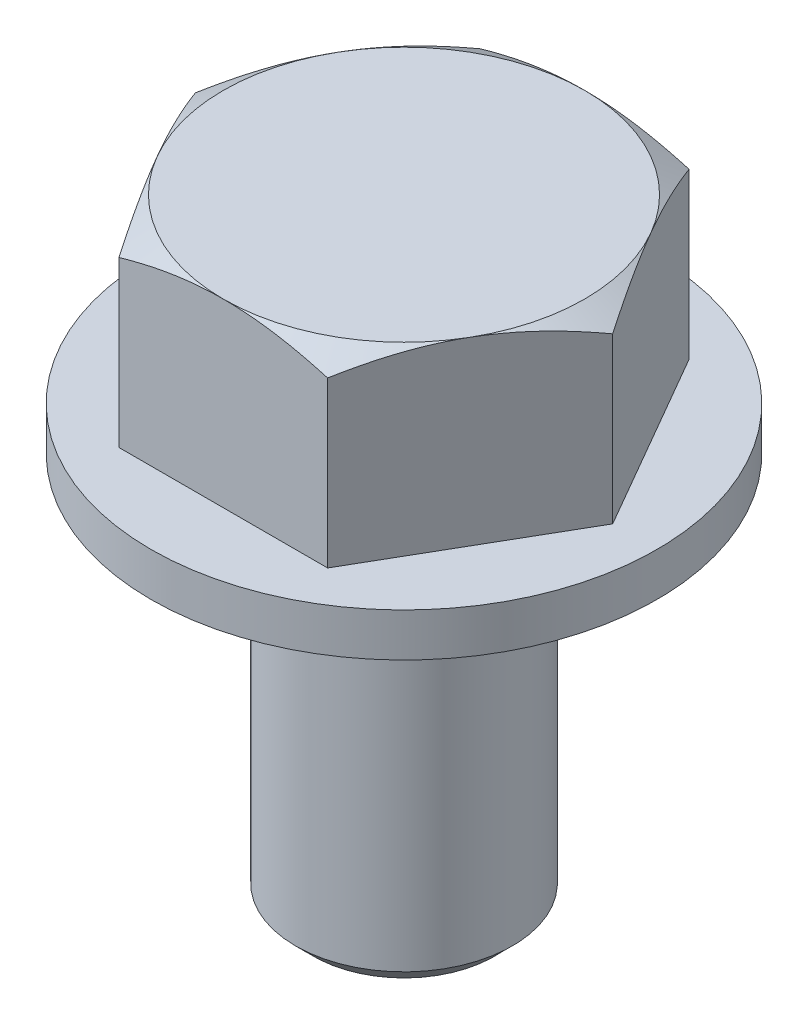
ISO-10303-21;
HEADER;
FILE_DESCRIPTION(('STEP AP214'),'2;1');
FILE_NAME('part.step','',(''),(''),'','','');
FILE_SCHEMA(('AUTOMOTIVE_DESIGN { 1 0 10303 214 1 1 1 1 }'));
ENDSEC;
DATA;
#1=APPLICATION_CONTEXT('core data for automotive mechanical design processes');
#2=APPLICATION_PROTOCOL_DEFINITION('international standard','automotive_design',2000,#1);
#3=PRODUCT_CONTEXT('',#1,'mechanical');
#4=PRODUCT('Part','Part','',(#3));
#5=PRODUCT_RELATED_PRODUCT_CATEGORY('part','',(#4));
#6=PRODUCT_DEFINITION_FORMATION('','',#4);
#7=PRODUCT_DEFINITION_CONTEXT('part definition',#1,'design');
#8=PRODUCT_DEFINITION('design','',#6,#7);
#9=PRODUCT_DEFINITION_SHAPE('','',#8);
#10=(LENGTH_UNIT() NAMED_UNIT(*) SI_UNIT(.MILLI.,.METRE.));
#11=(NAMED_UNIT(*) PLANE_ANGLE_UNIT() SI_UNIT($,.RADIAN.));
#12=(NAMED_UNIT(*) SI_UNIT($,.STERADIAN.) SOLID_ANGLE_UNIT());
#13=UNCERTAINTY_MEASURE_WITH_UNIT(LENGTH_MEASURE(1.E-05),#10,'distance_accuracy_value','');
#14=(GEOMETRIC_REPRESENTATION_CONTEXT(3) GLOBAL_UNCERTAINTY_ASSIGNED_CONTEXT((#13)) GLOBAL_UNIT_ASSIGNED_CONTEXT((#10,
#11,#12)) REPRESENTATION_CONTEXT('',''));
#15=CARTESIAN_POINT('',(0.,0.,0.));
#16=DIRECTION('',(0.,0.,1.));
#17=DIRECTION('',(1.,0.,0.));
#18=AXIS2_PLACEMENT_3D('',#15,#16,#17);
#19=CARTESIAN_POINT('',(8.66025403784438,-2.5,-5.00000000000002));
#20=DIRECTION('',(0.,1.,0.));
#21=DIRECTION('',(0.,0.,1.));
#22=AXIS2_PLACEMENT_3D('',#19,#20,#21);
#23=PLANE('',#22);
#24=CARTESIAN_POINT('',(0.,-2.5,0.));
#25=DIRECTION('',(0.,1.,0.));
#26=DIRECTION('',(0.,0.,1.));
#27=AXIS2_PLACEMENT_3D('',#24,#25,#26);
#28=CIRCLE('',#27,3.);
#29=CARTESIAN_POINT('',(0.,-2.5,3.));
#30=VERTEX_POINT('',#29);
#31=EDGE_CURVE('E147',#30,#30,#28,.F.);
#32=ORIENTED_EDGE('',*,*,#31,.F.);
#33=EDGE_LOOP('',(#32));
#34=FACE_BOUND('',#33,.T.);
#35=CARTESIAN_POINT('',(0.,-2.5,0.));
#36=DIRECTION('',(0.,1.,0.));
#37=DIRECTION('',(0.,0.,1.));
#38=AXIS2_PLACEMENT_3D('',#35,#36,#37);
#39=CIRCLE('',#38,3.5);
#40=CARTESIAN_POINT('',(0.,-2.5,3.5));
#41=VERTEX_POINT('',#40);
#42=EDGE_CURVE('E11',#41,#41,#39,.T.);
#43=ORIENTED_EDGE('',*,*,#42,.F.);
#44=EDGE_LOOP('',(#43));
#45=FACE_BOUND('',#44,.T.);
#46=ADVANCED_FACE('F31',(#34,#45),#23,.F.);
#47=CARTESIAN_POINT('',(0.,-14.5,0.));
#48=DIRECTION('',(0.,1.,0.));
#49=DIRECTION('',(0.,0.,1.));
#50=AXIS2_PLACEMENT_3D('',#47,#48,#49);
#51=CYLINDRICAL_SURFACE('',#50,3.);
#52=CARTESIAN_POINT('',(0.,-14.,0.));
#53=DIRECTION('',(0.,-1.,0.));
#54=DIRECTION('',(0.,0.,-1.));
#55=AXIS2_PLACEMENT_3D('',#52,#53,#54);
#56=CIRCLE('',#55,3.);
#57=CARTESIAN_POINT('',(0.,-14.,-3.));
#58=VERTEX_POINT('',#57);
#59=EDGE_CURVE('E40',#58,#58,#56,.F.);
#60=ORIENTED_EDGE('',*,*,#59,.T.);
#61=EDGE_LOOP('',(#60));
#62=FACE_BOUND('',#61,.T.);
#63=ORIENTED_EDGE('',*,*,#31,.T.);
#64=EDGE_LOOP('',(#63));
#65=FACE_BOUND('',#64,.T.);
#66=ADVANCED_FACE('F155',(#62,#65),#51,.T.);
#67=CARTESIAN_POINT('',(0.,-14.5,0.));
#68=DIRECTION('',(0.,-1.,0.));
#69=DIRECTION('',(0.,0.,-1.));
#70=AXIS2_PLACEMENT_3D('',#67,#68,#69);
#71=PLANE('',#70);
#72=CARTESIAN_POINT('',(0.,-14.5,0.));
#73=DIRECTION('',(0.,-1.,0.));
#74=DIRECTION('',(0.,0.,-1.));
#75=AXIS2_PLACEMENT_3D('',#72,#73,#74);
#76=CIRCLE('',#75,2.5);
#77=CARTESIAN_POINT('',(0.,-14.5,-2.5));
#78=VERTEX_POINT('',#77);
#79=EDGE_CURVE('E150',#78,#78,#76,.T.);
#80=ORIENTED_EDGE('',*,*,#79,.T.);
#81=EDGE_LOOP('',(#80));
#82=FACE_BOUND('',#81,.T.);
#83=ADVANCED_FACE('F161',(#82),#71,.T.);
#84=CARTESIAN_POINT('',(0.,-14.5,0.));
#85=DIRECTION('',(0.,1.,0.));
#86=DIRECTION('',(0.,0.,1.));
#87=AXIS2_PLACEMENT_3D('',#84,#85,#86);
#88=CONICAL_SURFACE('',#87,2.5,0.785398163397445);
#89=ORIENTED_EDGE('',*,*,#59,.F.);
#90=EDGE_LOOP('',(#89));
#91=FACE_BOUND('',#90,.T.);
#92=ORIENTED_EDGE('',*,*,#79,.F.);
#93=EDGE_LOOP('',(#92));
#94=FACE_BOUND('',#93,.T.);
#95=ADVANCED_FACE('F158',(#91,#94),#88,.T.);
#96=CARTESIAN_POINT('',(3.5,-2.5,0.));
#97=DIRECTION('',(0.,-1.,0.));
#98=DIRECTION('',(0.,0.,-1.));
#99=AXIS2_PLACEMENT_3D('',#96,#97,#98);
#100=PLANE('',#99);
#101=CARTESIAN_POINT('',(0.,-2.5,0.));
#102=DIRECTION('',(0.,1.,0.));
#103=DIRECTION('',(0.,0.,1.));
#104=AXIS2_PLACEMENT_3D('',#101,#102,#103);
#105=CIRCLE('',#104,7.);
#106=CARTESIAN_POINT('',(0.,-2.5,7.));
#107=VERTEX_POINT('',#106);
#108=EDGE_CURVE('E428',#107,#107,#105,.T.);
#109=ORIENTED_EDGE('',*,*,#108,.T.);
#110=EDGE_LOOP('',(#109));
#111=FACE_BOUND('',#110,.T.);
#112=DIRECTION('',(-0.5,0.,-0.866025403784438));
#113=VECTOR('',#112,1.);
#114=CARTESIAN_POINT('',(5.77350269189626,-2.5,0.));
#115=LINE('',#114,#113);
#116=CARTESIAN_POINT('',(5.77350269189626,-2.5,0.));
#117=VERTEX_POINT('',#116);
#118=CARTESIAN_POINT('',(2.88675134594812,-2.5,-5.00000000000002));
#119=VERTEX_POINT('',#118);
#120=EDGE_CURVE('E245',#117,#119,#115,.T.);
#121=ORIENTED_EDGE('',*,*,#120,.F.);
#122=DIRECTION('',(0.499999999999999,0.,-0.866025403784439));
#123=VECTOR('',#122,1.);
#124=CARTESIAN_POINT('',(2.88675134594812,-2.5,5.00000000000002));
#125=LINE('',#124,#123);
#126=CARTESIAN_POINT('',(2.88675134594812,-2.5,5.00000000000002));
#127=VERTEX_POINT('',#126);
#128=EDGE_CURVE('E55',#127,#117,#125,.T.);
#129=ORIENTED_EDGE('',*,*,#128,.F.);
#130=DIRECTION('',(1.,0.,0.));
#131=VECTOR('',#130,1.);
#132=CARTESIAN_POINT('',(-2.88675134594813,-2.5,5.00000000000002));
#133=LINE('',#132,#131);
#134=CARTESIAN_POINT('',(-2.88675134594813,-2.5,5.00000000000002));
#135=VERTEX_POINT('',#134);
#136=EDGE_CURVE('E103',#135,#127,#133,.T.);
#137=ORIENTED_EDGE('',*,*,#136,.F.);
#138=DIRECTION('',(0.5,0.,0.866025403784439));
#139=VECTOR('',#138,1.);
#140=CARTESIAN_POINT('',(-5.77350269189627,-2.5,0.));
#141=LINE('',#140,#139);
#142=CARTESIAN_POINT('',(-5.77350269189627,-2.5,0.));
#143=VERTEX_POINT('',#142);
#144=EDGE_CURVE('E107',#143,#135,#141,.T.);
#145=ORIENTED_EDGE('',*,*,#144,.F.);
#146=DIRECTION('',(-0.5,0.,0.866025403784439));
#147=VECTOR('',#146,1.);
#148=CARTESIAN_POINT('',(-2.88675134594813,-2.5,-5.00000000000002));
#149=LINE('',#148,#147);
#150=CARTESIAN_POINT('',(-2.88675134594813,-2.5,-5.00000000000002));
#151=VERTEX_POINT('',#150);
#152=EDGE_CURVE('E127',#151,#143,#149,.T.);
#153=ORIENTED_EDGE('',*,*,#152,.F.);
#154=DIRECTION('',(-1.,0.,0.));
#155=VECTOR('',#154,1.);
#156=CARTESIAN_POINT('',(2.88675134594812,-2.5,-5.00000000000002));
#157=LINE('',#156,#155);
#158=EDGE_CURVE('E129',#119,#151,#157,.T.);
#159=ORIENTED_EDGE('',*,*,#158,.F.);
#160=EDGE_LOOP('',(#121,#129,#137,#145,#153,#159));
#161=FACE_BOUND('',#160,.T.);
#162=ADVANCED_FACE('F105',(#111,#161),#100,.F.);
#163=CARTESIAN_POINT('',(0.,0.,0.));
#164=DIRECTION('',(0.,1.,0.));
#165=DIRECTION('',(0.,0.,1.));
#166=AXIS2_PLACEMENT_3D('',#163,#164,#165);
#167=CYLINDRICAL_SURFACE('',#166,3.5);
#168=CARTESIAN_POINT('',(0.,-3.7,0.));
#169=DIRECTION('',(0.,1.,0.));
#170=DIRECTION('',(0.,0.,1.));
#171=AXIS2_PLACEMENT_3D('',#168,#169,#170);
#172=CIRCLE('',#171,3.5);
#173=CARTESIAN_POINT('',(0.,-3.7,3.5));
#174=VERTEX_POINT('',#173);
#175=EDGE_CURVE('E200',#174,#174,#172,.T.);
#176=ORIENTED_EDGE('',*,*,#175,.F.);
#177=EDGE_LOOP('',(#176));
#178=FACE_BOUND('',#177,.T.);
#179=ORIENTED_EDGE('',*,*,#42,.T.);
#180=EDGE_LOOP('',(#179));
#181=FACE_BOUND('',#180,.T.);
#182=ADVANCED_FACE('F349',(#178,#181),#167,.F.);
#183=CARTESIAN_POINT('',(3.5,-3.7,0.));
#184=DIRECTION('',(0.,1.,0.));
#185=DIRECTION('',(0.,0.,1.));
#186=AXIS2_PLACEMENT_3D('',#183,#184,#185);
#187=PLANE('',#186);
#188=CARTESIAN_POINT('',(0.,-3.7,0.));
#189=DIRECTION('',(0.,1.,0.));
#190=DIRECTION('',(0.,0.,1.));
#191=AXIS2_PLACEMENT_3D('',#188,#189,#190);
#192=CIRCLE('',#191,7.);
#193=CARTESIAN_POINT('',(0.,-3.7,7.));
#194=VERTEX_POINT('',#193);
#195=EDGE_CURVE('E431',#194,#194,#192,.T.);
#196=ORIENTED_EDGE('',*,*,#195,.F.);
#197=EDGE_LOOP('',(#196));
#198=FACE_BOUND('',#197,.T.);
#199=ORIENTED_EDGE('',*,*,#175,.T.);
#200=EDGE_LOOP('',(#199));
#201=FACE_BOUND('',#200,.T.);
#202=ADVANCED_FACE('F359',(#198,#201),#187,.F.);
#203=CARTESIAN_POINT('',(0.,0.,0.));
#204=DIRECTION('',(0.,1.,0.));
#205=DIRECTION('',(0.,0.,1.));
#206=AXIS2_PLACEMENT_3D('',#203,#204,#205);
#207=CYLINDRICAL_SURFACE('',#206,7.);
#208=ORIENTED_EDGE('',*,*,#108,.F.);
#209=EDGE_LOOP('',(#208));
#210=FACE_BOUND('',#209,.T.);
#211=ORIENTED_EDGE('',*,*,#195,.T.);
#212=EDGE_LOOP('',(#211));
#213=FACE_BOUND('',#212,.T.);
#214=ADVANCED_FACE('F186',(#210,#213),#207,.T.);
#215=CARTESIAN_POINT('',(8.66025403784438,2.5,-5.00000000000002));
#216=DIRECTION('',(0.,1.,0.));
#217=DIRECTION('',(0.,0.,1.));
#218=AXIS2_PLACEMENT_3D('',#215,#216,#217);
#219=PLANE('',#218);
#220=CARTESIAN_POINT('',(0.,2.5,0.));
#221=DIRECTION('',(0.,1.,0.));
#222=DIRECTION('',(0.,0.,1.));
#223=AXIS2_PLACEMENT_3D('',#220,#221,#222);
#224=CIRCLE('',#223,5.00000000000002);
#225=CARTESIAN_POINT('',(-4.3301270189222,2.5,2.5));
#226=VERTEX_POINT('',#225);
#227=CARTESIAN_POINT('',(0.,2.5,5.00000000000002));
#228=VERTEX_POINT('',#227);
#229=EDGE_CURVE('E47',#226,#228,#224,.T.);
#230=ORIENTED_EDGE('',*,*,#229,.T.);
#231=CARTESIAN_POINT('',(4.33012701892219,2.5,2.5));
#232=VERTEX_POINT('',#231);
#233=EDGE_CURVE('E146',#228,#232,#224,.T.);
#234=ORIENTED_EDGE('',*,*,#233,.T.);
#235=CARTESIAN_POINT('',(4.3301270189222,2.5,-2.5));
#236=VERTEX_POINT('',#235);
#237=EDGE_CURVE('E266',#232,#236,#224,.T.);
#238=ORIENTED_EDGE('',*,*,#237,.T.);
#239=CARTESIAN_POINT('',(0.,2.5,-5.00000000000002));
#240=VERTEX_POINT('',#239);
#241=EDGE_CURVE('E265',#236,#240,#224,.T.);
#242=ORIENTED_EDGE('',*,*,#241,.T.);
#243=CARTESIAN_POINT('',(-4.3301270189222,2.5,-2.5));
#244=VERTEX_POINT('',#243);
#245=EDGE_CURVE('E259',#240,#244,#224,.T.);
#246=ORIENTED_EDGE('',*,*,#245,.T.);
#247=EDGE_CURVE('E145',#244,#226,#224,.T.);
#248=ORIENTED_EDGE('',*,*,#247,.T.);
#249=EDGE_LOOP('',(#230,#234,#238,#242,#246,#248));
#250=FACE_BOUND('',#249,.T.);
#251=ADVANCED_FACE('F182',(#250),#219,.T.);
#252=CARTESIAN_POINT('',(0.,4.23205080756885,0.));
#253=DIRECTION('',(0.,-1.,0.));
#254=DIRECTION('',(0.,0.,-1.));
#255=AXIS2_PLACEMENT_3D('',#252,#253,#254);
#256=CONICAL_SURFACE('',#255,2.00000000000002,1.0471975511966);
#257=CARTESIAN_POINT('',(5.7736181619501,2.05335134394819,0.000199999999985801));
#258=CARTESIAN_POINT('',(5.64675433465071,2.12661343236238,-0.219534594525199));
#259=CARTESIAN_POINT('',(5.5188054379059,2.19324867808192,-0.441148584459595));
#260=CARTESIAN_POINT('',(5.26069210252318,2.3095610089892,-0.888213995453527));
#261=CARTESIAN_POINT('',(5.13052307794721,2.35919695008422,-1.11367335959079));
#262=CARTESIAN_POINT('',(4.87177839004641,2.43644897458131,-1.56183230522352));
#263=CARTESIAN_POINT('',(4.74324302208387,2.46457962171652,-1.7844620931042));
#264=CARTESIAN_POINT('',(4.54998783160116,2.48980507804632,-2.11918990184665));
#265=CARTESIAN_POINT('',(4.48552534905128,2.49538654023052,-2.23084219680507));
#266=CARTESIAN_POINT('',(4.35654081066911,2.50079778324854,-2.45424997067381));
#267=CARTESIAN_POINT('',(4.2920187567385,2.5006277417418,-2.56600544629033));
#268=CARTESIAN_POINT('',(4.11524635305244,2.49224636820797,-2.87218423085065));
#269=CARTESIAN_POINT('',(4.00305457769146,2.47817022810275,-3.06650608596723));
#270=CARTESIAN_POINT('',(3.77941563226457,2.43353474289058,-3.45386010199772));
#271=CARTESIAN_POINT('',(3.66796924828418,2.4029601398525,-3.64689090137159));
#272=CARTESIAN_POINT('',(3.44387972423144,2.32653150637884,-4.03502534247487));
#273=CARTESIAN_POINT('',(3.3312648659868,2.28035362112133,-4.23007999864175));
#274=CARTESIAN_POINT('',(3.1077146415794,2.17554820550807,-4.61728034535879));
#275=CARTESIAN_POINT('',(2.99677641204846,2.11694529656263,-4.80943099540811));
#276=CARTESIAN_POINT('',(2.88663587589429,2.05335134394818,-5.00020000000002));
#277=B_SPLINE_CURVE_WITH_KNOTS('',3,(#257,#258,#259,#260,#261,#262,#263,#264,#265,#266,#267,
#268,#269,#270,#271,#272,#273,#274,#275,#276),.UNSPECIFIED.,.F.,.F.,(4,2,2,2,2,2,2,2,2,4),(0.,
0.79255584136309,1.58701660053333,2.3618153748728,2.74884076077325,3.13585419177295,
3.80962362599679,4.48401723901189,5.17336882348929,5.86136694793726),.UNSPECIFIED.);
#278=CARTESIAN_POINT('',(5.77350269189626,2.05341801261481,0.));
#279=VERTEX_POINT('',#278);
#280=EDGE_CURVE('E207',#279,#236,#277,.T.);
#281=ORIENTED_EDGE('',*,*,#280,.T.);
#282=ORIENTED_EDGE('',*,*,#237,.F.);
#283=CARTESIAN_POINT('',(2.88663587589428,2.05335134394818,5.00020000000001));
#284=CARTESIAN_POINT('',(3.01349970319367,2.12661343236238,4.78046540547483));
#285=CARTESIAN_POINT('',(3.14144859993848,2.19324867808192,4.55885141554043));
#286=CARTESIAN_POINT('',(3.3995619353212,2.3095610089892,4.1117860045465));
#287=CARTESIAN_POINT('',(3.52973095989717,2.35919695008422,3.88632664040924));
#288=CARTESIAN_POINT('',(3.78847564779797,2.43644897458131,3.4381676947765));
#289=CARTESIAN_POINT('',(3.91701101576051,2.46457962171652,3.21553790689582));
#290=CARTESIAN_POINT('',(4.11026620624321,2.48980507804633,2.88081009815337));
#291=CARTESIAN_POINT('',(4.1747286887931,2.49538654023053,2.76915780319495));
#292=CARTESIAN_POINT('',(4.30371322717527,2.50079778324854,2.54575002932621));
#293=CARTESIAN_POINT('',(4.36823528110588,2.50062774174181,2.4339945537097));
#294=CARTESIAN_POINT('',(4.54500768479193,2.49224636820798,2.12781576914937));
#295=CARTESIAN_POINT('',(4.65719946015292,2.47817022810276,1.93349391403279));
#296=CARTESIAN_POINT('',(4.88083840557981,2.43353474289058,1.5461398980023));
#297=CARTESIAN_POINT('',(4.9922847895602,2.40296013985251,1.35310909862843));
#298=CARTESIAN_POINT('',(5.21637431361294,2.32653150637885,0.964974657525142));
#299=CARTESIAN_POINT('',(5.32898917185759,2.28035362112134,0.769920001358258));
#300=CARTESIAN_POINT('',(5.55253939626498,2.17554820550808,0.382719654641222));
#301=CARTESIAN_POINT('',(5.66347762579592,2.11694529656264,0.190569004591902));
#302=CARTESIAN_POINT('',(5.7736181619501,2.05335134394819,-0.000200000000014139));
#303=B_SPLINE_CURVE_WITH_KNOTS('',3,(#283,#284,#285,#286,#287,#288,#289,#290,#291,#292,#293,
#294,#295,#296,#297,#298,#299,#300,#301,#302),.UNSPECIFIED.,.F.,.F.,(4,2,2,2,2,2,2,2,2,4),(0.,
0.792555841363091,1.58701660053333,2.36181537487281,2.74884076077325,3.13585419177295,
3.8096236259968,4.48401723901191,5.17336882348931,5.86136694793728),.UNSPECIFIED.);
#304=EDGE_CURVE('E199',#232,#279,#303,.T.);
#305=ORIENTED_EDGE('',*,*,#304,.T.);
#306=EDGE_LOOP('',(#281,#282,#305));
#307=FACE_BOUND('',#306,.T.);
#308=ADVANCED_FACE('F185',(#307),#256,.T.);
#309=CARTESIAN_POINT('',(-7.83582824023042,0.0201818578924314,-5.00000000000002));
#310=CARTESIAN_POINT('',(-7.61675258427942,0.126778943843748,-5.00000000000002));
#311=CARTESIAN_POINT('',(-7.39718272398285,0.232377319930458,-5.00000000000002));
#312=CARTESIAN_POINT('',(-6.95679209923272,0.441016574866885,-5.00000000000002));
#313=CARTESIAN_POINT('',(-6.73597115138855,0.54405706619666,-5.00000000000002));
#314=CARTESIAN_POINT('',(-6.29171673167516,0.747521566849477,-5.00000000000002));
#315=CARTESIAN_POINT('',(-6.06827562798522,0.847928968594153,-5.00000000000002));
#316=CARTESIAN_POINT('',(-5.61964466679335,1.04474266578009,-5.00000000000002));
#317=CARTESIAN_POINT('',(-5.39445489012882,1.14114914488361,-5.00000000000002));
#318=CARTESIAN_POINT('',(-4.93438073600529,1.33205603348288,-5.00000000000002));
#319=CARTESIAN_POINT('',(-4.69942447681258,1.42638413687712,-5.00000000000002));
#320=CARTESIAN_POINT('',(-4.22679335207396,1.60809698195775,-5.00000000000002));
#321=CARTESIAN_POINT('',(-3.98911818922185,1.69548095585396,-5.00000000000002));
#322=CARTESIAN_POINT('',(-3.51109032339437,1.86107114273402,-5.00000000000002));
#323=CARTESIAN_POINT('',(-3.27074388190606,1.93929525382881,-5.00000000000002));
#324=CARTESIAN_POINT('',(-2.78660382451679,2.08410963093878,-5.00000000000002));
#325=CARTESIAN_POINT('',(-2.54281129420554,2.15070347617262,-5.00000000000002));
#326=CARTESIAN_POINT('',(-2.05301710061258,2.26875493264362,-5.00000000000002));
#327=CARTESIAN_POINT('',(-1.80703640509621,2.32029796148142,-5.00000000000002));
#328=CARTESIAN_POINT('',(-1.31193168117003,2.40539626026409,-5.00000000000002));
#329=CARTESIAN_POINT('',(-1.0628079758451,2.43895336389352,-5.00000000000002));
#330=CARTESIAN_POINT('',(-0.565948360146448,2.48496717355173,-5.00000000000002));
#331=CARTESIAN_POINT('',(-0.318238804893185,2.49770143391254,-5.00000000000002));
#332=CARTESIAN_POINT('',(0.177377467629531,2.50172580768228,-5.00000000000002));
#333=CARTESIAN_POINT('',(0.425284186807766,2.4930157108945,-5.00000000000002));
#334=CARTESIAN_POINT('',(0.843772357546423,2.46083600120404,-5.00000000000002));
#335=CARTESIAN_POINT('',(1.01479089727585,2.44270146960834,-5.00000000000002));
#336=CARTESIAN_POINT('',(1.35562158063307,2.39731277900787,-5.00000000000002));
#337=CARTESIAN_POINT('',(1.52543356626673,2.37005744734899,-5.00000000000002));
#338=CARTESIAN_POINT('',(2.0328088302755,2.2760379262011,-5.00000000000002));
#339=CARTESIAN_POINT('',(2.36813213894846,2.19703587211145,-5.00000000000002));
#340=CARTESIAN_POINT('',(2.86963272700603,2.05946652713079,-5.00000000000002));
#341=CARTESIAN_POINT('',(3.03839424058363,2.00977811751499,-5.00000000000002));
#342=CARTESIAN_POINT('',(3.37427940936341,1.90509537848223,-5.00000000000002));
#343=CARTESIAN_POINT('',(3.54140305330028,1.85010101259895,-5.00000000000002));
#344=CARTESIAN_POINT('',(3.87406252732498,1.73570084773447,-5.00000000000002));
#345=CARTESIAN_POINT('',(4.03959882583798,1.67629639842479,-5.00000000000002));
#346=CARTESIAN_POINT('',(4.36929036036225,1.55378935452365,-5.00000000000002));
#347=CARTESIAN_POINT('',(4.53344561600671,1.49068681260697,-5.00000000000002));
#348=CARTESIAN_POINT('',(4.93359002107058,1.33251408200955,-5.00000000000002));
#349=CARTESIAN_POINT('',(5.16891080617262,1.23575576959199,-5.00000000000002));
#350=CARTESIAN_POINT('',(5.63743106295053,1.03721704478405,-5.00000000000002));
#351=CARTESIAN_POINT('',(5.87063037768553,0.935436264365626,-5.00000000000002));
#352=CARTESIAN_POINT('',(6.33531777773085,0.727904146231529,-5.00000000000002));
#353=CARTESIAN_POINT('',(6.56680543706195,0.622151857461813,-5.00000000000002));
#354=CARTESIAN_POINT('',(7.02832278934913,0.407506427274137,-5.00000000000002));
#355=CARTESIAN_POINT('',(7.25835244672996,0.298613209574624,-5.00000000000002));
#356=CARTESIAN_POINT('',(7.71747583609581,0.0781683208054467,-5.00000000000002));
#357=CARTESIAN_POINT('',(7.94656809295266,-0.0333864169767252,-5.00000000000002));
#358=CARTESIAN_POINT('',(8.40373705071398,-0.258559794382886,-5.00000000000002));
#359=CARTESIAN_POINT('',(8.63181374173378,-0.372178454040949,-5.00000000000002));
#360=CARTESIAN_POINT('',(9.31470112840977,-0.715524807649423,-5.00000000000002));
#361=CARTESIAN_POINT('',(9.76824174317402,-0.947778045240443,-5.00000000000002));
#362=CARTESIAN_POINT('',(10.6324695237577,-1.39599360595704,-5.00000000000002));
#363=CARTESIAN_POINT('',(11.0433644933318,-1.61155711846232,-5.00000000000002));
#364=CARTESIAN_POINT('',(11.8636388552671,-2.04558815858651,-5.00000000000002));
#365=CARTESIAN_POINT('',(12.2730181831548,-2.26405580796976,-5.00000000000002));
#366=CARTESIAN_POINT('',(13.0894643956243,-2.70257621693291,-5.00000000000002));
#367=CARTESIAN_POINT('',(13.4965345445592,-2.92262290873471,-5.00000000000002));
#368=CARTESIAN_POINT('',(14.3097130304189,-3.36442738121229,-5.00000000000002));
#369=CARTESIAN_POINT('',(14.7158214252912,-3.58618505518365,-5.00000000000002));
#370=CARTESIAN_POINT('',(15.1215799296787,-3.80857680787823,-5.00000000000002));
#371=B_SPLINE_CURVE_WITH_KNOTS('',3,(#309,#310,#311,#312,#313,#314,#315,#316,#317,#318,#319,
#320,#321,#322,#323,#324,#325,#326,#327,#328,#329,#330,#331,#332,#333,#334,#335,#336,#337,#338,
#339,#340,#341,#342,#343,#344,#345,#346,#347,#348,#349,#350,#351,#352,#353,#354,#355,#356,#357,
#358,#359,#360,#361,#362,#363,#364,#365,#366,#367,#368,#369,#370),.UNSPECIFIED.,.F.,.F.,(4,2,2,
2,2,2,2,2,2,2,2,2,2,2,2,2,2,2,2,2,2,2,2,2,2,2,2,2,2,2,4),(0.,0.730907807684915,1.46192568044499,
2.19678752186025,2.93161559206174,3.69108328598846,4.450634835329,5.20867656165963,
5.96648458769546,6.71990430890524,7.47324720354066,8.21646418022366,8.95968844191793,
9.47537174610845,9.99112137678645,11.0231580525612,11.5508843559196,12.0786142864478,
12.6061833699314,13.1337449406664,13.8969744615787,14.6602599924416,15.4237294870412,
16.187217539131,16.9516324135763,17.7160547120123,19.2446573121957,20.636665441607,
22.0287321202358,23.416942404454,24.805066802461),.UNSPECIFIED.);
#372=CARTESIAN_POINT('',(2.88675134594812,2.05341801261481,-5.00000000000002));
#373=VERTEX_POINT('',#372);
#374=EDGE_CURVE('E213',#373,#240,#371,.F.);
#375=ORIENTED_EDGE('',*,*,#374,.T.);
#376=ORIENTED_EDGE('',*,*,#241,.F.);
#377=EDGE_CURVE('E212',#236,#373,#277,.T.);
#378=ORIENTED_EDGE('',*,*,#377,.T.);
#379=EDGE_LOOP('',(#375,#376,#378));
#380=FACE_BOUND('',#379,.T.);
#381=ADVANCED_FACE('F278',(#380),#256,.T.);
#382=CARTESIAN_POINT('',(-2.8866358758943,2.05335134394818,-5.00020000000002));
#383=CARTESIAN_POINT('',(-3.01349970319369,2.12661343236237,-4.78046540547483));
#384=CARTESIAN_POINT('',(-3.1414485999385,2.19324867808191,-4.55885141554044));
#385=CARTESIAN_POINT('',(-3.39956193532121,2.30956100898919,-4.1117860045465));
#386=CARTESIAN_POINT('',(-3.52973095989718,2.35919695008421,-3.88632664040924));
#387=CARTESIAN_POINT('',(-3.78847564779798,2.43644897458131,-3.4381676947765));
#388=CARTESIAN_POINT('',(-3.91701101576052,2.46457962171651,-3.21553790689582));
#389=CARTESIAN_POINT('',(-4.11026620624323,2.48980507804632,-2.88081009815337));
#390=CARTESIAN_POINT('',(-4.17472868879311,2.49538654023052,-2.76915780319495));
#391=CARTESIAN_POINT('',(-4.30371322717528,2.50079778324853,-2.54575002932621));
#392=CARTESIAN_POINT('',(-4.3682352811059,2.5006277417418,-2.4339945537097));
#393=CARTESIAN_POINT('',(-4.54500768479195,2.49224636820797,-2.12781576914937));
#394=CARTESIAN_POINT('',(-4.65719946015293,2.47817022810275,-1.9334939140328));
#395=CARTESIAN_POINT('',(-4.88083840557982,2.43353474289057,-1.5461398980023));
#396=CARTESIAN_POINT('',(-4.99228478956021,2.4029601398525,-1.35310909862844));
#397=CARTESIAN_POINT('',(-5.21637431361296,2.32653150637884,-0.964974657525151));
#398=CARTESIAN_POINT('',(-5.3289891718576,2.28035362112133,-0.769920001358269));
#399=CARTESIAN_POINT('',(-5.55253939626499,2.17554820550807,-0.382719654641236));
#400=CARTESIAN_POINT('',(-5.66347762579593,2.11694529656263,-0.190569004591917));
#401=CARTESIAN_POINT('',(-5.77361816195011,2.05335134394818,0.000199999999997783));
#402=B_SPLINE_CURVE_WITH_KNOTS('',3,(#382,#383,#384,#385,#386,#387,#388,#389,#390,#391,#392,
#393,#394,#395,#396,#397,#398,#399,#400,#401),.UNSPECIFIED.,.F.,.F.,(4,2,2,2,2,2,2,2,2,4),(0.,
0.792555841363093,1.58701660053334,2.36181537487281,2.74884076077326,3.13585419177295,
3.8096236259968,4.4840172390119,5.1733688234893,5.86136694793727),.UNSPECIFIED.);
#403=CARTESIAN_POINT('',(-2.88675134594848,2.05341801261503,-5.00000000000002));
#404=VERTEX_POINT('',#403);
#405=EDGE_CURVE('E231',#404,#244,#402,.T.);
#406=ORIENTED_EDGE('',*,*,#405,.T.);
#407=ORIENTED_EDGE('',*,*,#245,.F.);
#408=EDGE_CURVE('E237',#240,#404,#371,.F.);
#409=ORIENTED_EDGE('',*,*,#408,.T.);
#410=EDGE_LOOP('',(#406,#407,#409));
#411=FACE_BOUND('',#410,.T.);
#412=ADVANCED_FACE('F257',(#411),#256,.T.);
#413=CARTESIAN_POINT('',(-5.77361816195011,2.05335134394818,-0.000200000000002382));
#414=CARTESIAN_POINT('',(-5.64675433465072,2.12661343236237,0.219534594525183));
#415=CARTESIAN_POINT('',(-5.51880543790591,2.19324867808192,0.441148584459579));
#416=CARTESIAN_POINT('',(-5.26069210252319,2.3095610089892,0.888213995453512));
#417=CARTESIAN_POINT('',(-5.13052307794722,2.35919695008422,1.11367335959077));
#418=CARTESIAN_POINT('',(-4.87177839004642,2.43644897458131,1.56183230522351));
#419=CARTESIAN_POINT('',(-4.74324302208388,2.46457962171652,1.78446209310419));
#420=CARTESIAN_POINT('',(-4.54998783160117,2.48980507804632,2.11918990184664));
#421=CARTESIAN_POINT('',(-4.48552534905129,2.49538654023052,2.23084219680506));
#422=CARTESIAN_POINT('',(-4.35654081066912,2.50079778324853,2.4542499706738));
#423=CARTESIAN_POINT('',(-4.29201875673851,2.5006277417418,2.56600544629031));
#424=CARTESIAN_POINT('',(-4.11524635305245,2.49224636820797,2.87218423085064));
#425=CARTESIAN_POINT('',(-4.00305457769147,2.47817022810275,3.06650608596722));
#426=CARTESIAN_POINT('',(-3.77941563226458,2.43353474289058,3.45386010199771));
#427=CARTESIAN_POINT('',(-3.66796924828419,2.4029601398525,3.64689090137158));
#428=CARTESIAN_POINT('',(-3.44387972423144,2.32653150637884,4.03502534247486));
#429=CARTESIAN_POINT('',(-3.33126486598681,2.28035362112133,4.23007999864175));
#430=CARTESIAN_POINT('',(-3.10771464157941,2.17554820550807,4.61728034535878));
#431=CARTESIAN_POINT('',(-2.99677641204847,2.11694529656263,4.8094309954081));
#432=CARTESIAN_POINT('',(-2.88663587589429,2.05335134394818,5.00020000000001));
#433=B_SPLINE_CURVE_WITH_KNOTS('',3,(#413,#414,#415,#416,#417,#418,#419,#420,#421,#422,#423,
#424,#425,#426,#427,#428,#429,#430,#431,#432),.UNSPECIFIED.,.F.,.F.,(4,2,2,2,2,2,2,2,2,4),(0.,
0.792555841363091,1.58701660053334,2.36181537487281,2.74884076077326,3.13585419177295,
3.8096236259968,4.4840172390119,5.1733688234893,5.86136694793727),.UNSPECIFIED.);
#434=CARTESIAN_POINT('',(-5.77350269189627,2.05341801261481,0.));
#435=VERTEX_POINT('',#434);
#436=EDGE_CURVE('E238',#435,#226,#433,.T.);
#437=ORIENTED_EDGE('',*,*,#436,.T.);
#438=ORIENTED_EDGE('',*,*,#247,.F.);
#439=EDGE_CURVE('E236',#244,#435,#402,.T.);
#440=ORIENTED_EDGE('',*,*,#439,.T.);
#441=EDGE_LOOP('',(#437,#438,#440));
#442=FACE_BOUND('',#441,.T.);
#443=ADVANCED_FACE('F262',(#442),#256,.T.);
#444=CARTESIAN_POINT('',(2.88675134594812,2.05341801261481,5.00000000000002));
#445=VERTEX_POINT('',#444);
#446=EDGE_CURVE('E206',#445,#232,#303,.T.);
#447=ORIENTED_EDGE('',*,*,#446,.T.);
#448=ORIENTED_EDGE('',*,*,#233,.F.);
#449=CARTESIAN_POINT('',(-7.83582824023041,0.0201818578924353,5.00000000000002));
#450=CARTESIAN_POINT('',(-7.61675258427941,0.126778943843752,5.00000000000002));
#451=CARTESIAN_POINT('',(-7.39718272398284,0.232377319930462,5.00000000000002));
#452=CARTESIAN_POINT('',(-6.95679209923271,0.441016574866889,5.00000000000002));
#453=CARTESIAN_POINT('',(-6.73597115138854,0.544057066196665,5.00000000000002));
#454=CARTESIAN_POINT('',(-6.29171673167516,0.747521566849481,5.00000000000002));
#455=CARTESIAN_POINT('',(-6.06827562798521,0.847928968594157,5.00000000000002));
#456=CARTESIAN_POINT('',(-5.61964466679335,1.0447426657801,5.00000000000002));
#457=CARTESIAN_POINT('',(-5.39445489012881,1.14114914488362,5.00000000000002));
#458=CARTESIAN_POINT('',(-4.93438073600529,1.33205603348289,5.00000000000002));
#459=CARTESIAN_POINT('',(-4.69942447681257,1.42638413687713,5.00000000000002));
#460=CARTESIAN_POINT('',(-4.22679335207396,1.60809698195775,5.00000000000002));
#461=CARTESIAN_POINT('',(-3.98911818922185,1.69548095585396,5.00000000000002));
#462=CARTESIAN_POINT('',(-3.51109032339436,1.86107114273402,5.00000000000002));
#463=CARTESIAN_POINT('',(-3.27074388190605,1.93929525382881,5.00000000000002));
#464=CARTESIAN_POINT('',(-2.78660382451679,2.08410963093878,5.00000000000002));
#465=CARTESIAN_POINT('',(-2.54281129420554,2.15070347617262,5.00000000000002));
#466=CARTESIAN_POINT('',(-2.05301710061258,2.26875493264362,5.00000000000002));
#467=CARTESIAN_POINT('',(-1.80703640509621,2.32029796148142,5.00000000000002));
#468=CARTESIAN_POINT('',(-1.31193168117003,2.40539626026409,5.00000000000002));
#469=CARTESIAN_POINT('',(-1.0628079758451,2.43895336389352,5.00000000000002));
#470=CARTESIAN_POINT('',(-0.565948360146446,2.48496717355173,5.00000000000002));
#471=CARTESIAN_POINT('',(-0.318238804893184,2.49770143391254,5.00000000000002));
#472=CARTESIAN_POINT('',(0.177377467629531,2.50172580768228,5.00000000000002));
#473=CARTESIAN_POINT('',(0.425284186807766,2.4930157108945,5.00000000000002));
#474=CARTESIAN_POINT('',(0.843772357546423,2.46083600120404,5.00000000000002));
#475=CARTESIAN_POINT('',(1.01479089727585,2.44270146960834,5.00000000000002));
#476=CARTESIAN_POINT('',(1.35562158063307,2.39731277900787,5.00000000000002));
#477=CARTESIAN_POINT('',(1.52543356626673,2.37005744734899,5.00000000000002));
#478=CARTESIAN_POINT('',(2.0328088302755,2.2760379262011,5.00000000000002));
#479=CARTESIAN_POINT('',(2.36813213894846,2.19703587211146,5.00000000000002));
#480=CARTESIAN_POINT('',(2.86963272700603,2.05946652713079,5.00000000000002));
#481=CARTESIAN_POINT('',(3.03839424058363,2.009778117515,5.00000000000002));
#482=CARTESIAN_POINT('',(3.37427940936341,1.90509537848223,5.00000000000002));
#483=CARTESIAN_POINT('',(3.54140305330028,1.85010101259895,5.00000000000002));
#484=CARTESIAN_POINT('',(3.87406252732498,1.73570084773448,5.00000000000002));
#485=CARTESIAN_POINT('',(4.03959882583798,1.6762963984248,5.00000000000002));
#486=CARTESIAN_POINT('',(4.36929036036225,1.55378935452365,5.00000000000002));
#487=CARTESIAN_POINT('',(4.53344561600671,1.49068681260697,5.00000000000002));
#488=CARTESIAN_POINT('',(4.93359002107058,1.33251408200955,5.00000000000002));
#489=CARTESIAN_POINT('',(5.16891080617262,1.23575576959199,5.00000000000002));
#490=CARTESIAN_POINT('',(5.63743106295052,1.03721704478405,5.00000000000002));
#491=CARTESIAN_POINT('',(5.87063037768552,0.935436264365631,5.00000000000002));
#492=CARTESIAN_POINT('',(6.33531777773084,0.727904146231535,5.00000000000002));
#493=CARTESIAN_POINT('',(6.56680543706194,0.62215185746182,5.00000000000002));
#494=CARTESIAN_POINT('',(7.02832278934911,0.407506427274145,5.00000000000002));
#495=CARTESIAN_POINT('',(7.25835244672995,0.298613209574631,5.00000000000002));
#496=CARTESIAN_POINT('',(7.71747583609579,0.078168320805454,5.00000000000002));
#497=CARTESIAN_POINT('',(7.94656809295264,-0.0333864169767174,5.00000000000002));
#498=CARTESIAN_POINT('',(8.40373705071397,-0.258559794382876,5.00000000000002));
#499=CARTESIAN_POINT('',(8.63181374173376,-0.372178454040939,5.00000000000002));
#500=CARTESIAN_POINT('',(9.31470112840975,-0.715524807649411,5.00000000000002));
#501=CARTESIAN_POINT('',(9.76824174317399,-0.94777804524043,5.00000000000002));
#502=CARTESIAN_POINT('',(10.6324695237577,-1.39599360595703,5.00000000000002));
#503=CARTESIAN_POINT('',(11.0433644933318,-1.61155711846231,5.00000000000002));
#504=CARTESIAN_POINT('',(11.8636388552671,-2.0455881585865,5.00000000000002));
#505=CARTESIAN_POINT('',(12.2730181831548,-2.26405580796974,5.00000000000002));
#506=CARTESIAN_POINT('',(13.0894643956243,-2.7025762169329,5.00000000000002));
#507=CARTESIAN_POINT('',(13.4965345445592,-2.92262290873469,5.00000000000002));
#508=CARTESIAN_POINT('',(14.3097130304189,-3.36442738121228,5.00000000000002));
#509=CARTESIAN_POINT('',(14.7158214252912,-3.58618505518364,5.00000000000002));
#510=CARTESIAN_POINT('',(15.1215799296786,-3.80857680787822,5.00000000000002));
#511=B_SPLINE_CURVE_WITH_KNOTS('',3,(#449,#450,#451,#452,#453,#454,#455,#456,#457,#458,#459,
#460,#461,#462,#463,#464,#465,#466,#467,#468,#469,#470,#471,#472,#473,#474,#475,#476,#477,#478,
#479,#480,#481,#482,#483,#484,#485,#486,#487,#488,#489,#490,#491,#492,#493,#494,#495,#496,#497,
#498,#499,#500,#501,#502,#503,#504,#505,#506,#507,#508,#509,#510),.UNSPECIFIED.,.F.,.F.,(4,2,2,
2,2,2,2,2,2,2,2,2,2,2,2,2,2,2,2,2,2,2,2,2,2,2,2,2,2,2,4),(0.,0.730907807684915,1.46192568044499,
2.19678752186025,2.93161559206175,3.69108328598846,4.450634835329,5.20867656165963,
5.96648458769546,6.71990430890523,7.47324720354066,8.21646418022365,8.95968844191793,
9.47537174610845,9.99112137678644,11.0231580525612,11.5508843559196,12.0786142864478,
12.6061833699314,13.1337449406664,13.8969744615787,14.6602599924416,15.4237294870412,
16.1872175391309,16.9516324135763,17.7160547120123,19.2446573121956,20.636665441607,
22.0287321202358,23.416942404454,24.805066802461),.UNSPECIFIED.);
#512=EDGE_CURVE('E193',#228,#445,#511,.T.);
#513=ORIENTED_EDGE('',*,*,#512,.T.);
#514=EDGE_LOOP('',(#447,#448,#513));
#515=FACE_BOUND('',#514,.T.);
#516=ADVANCED_FACE('F284',(#515),#256,.T.);
#517=CARTESIAN_POINT('',(-2.88675134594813,2.0534180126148,5.00000000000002));
#518=VERTEX_POINT('',#517);
#519=EDGE_CURVE('E118',#518,#228,#511,.T.);
#520=ORIENTED_EDGE('',*,*,#519,.T.);
#521=ORIENTED_EDGE('',*,*,#229,.F.);
#522=EDGE_CURVE('E243',#226,#518,#433,.T.);
#523=ORIENTED_EDGE('',*,*,#522,.T.);
#524=EDGE_LOOP('',(#520,#521,#523));
#525=FACE_BOUND('',#524,.T.);
#526=ADVANCED_FACE('F180',(#525),#256,.T.);
#527=CARTESIAN_POINT('',(-2.88675134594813,2.5,5.00000000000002));
#528=DIRECTION('',(0.,0.,-1.));
#529=DIRECTION('',(-1.,0.,0.));
#530=AXIS2_PLACEMENT_3D('',#527,#528,#529);
#531=PLANE('',#530);
#532=ORIENTED_EDGE('',*,*,#519,.F.);
#533=DIRECTION('',(0.,-1.,0.));
#534=VECTOR('',#533,1.);
#535=CARTESIAN_POINT('',(-2.88675134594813,2.5,5.00000000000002));
#536=LINE('',#535,#534);
#537=EDGE_CURVE('E115',#518,#135,#536,.T.);
#538=ORIENTED_EDGE('',*,*,#537,.T.);
#539=ORIENTED_EDGE('',*,*,#136,.T.);
#540=DIRECTION('',(0.,-1.,0.));
#541=VECTOR('',#540,1.);
#542=CARTESIAN_POINT('',(2.88675134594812,2.5,5.00000000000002));
#543=LINE('',#542,#541);
#544=EDGE_CURVE('E111',#445,#127,#543,.T.);
#545=ORIENTED_EDGE('',*,*,#544,.F.);
#546=ORIENTED_EDGE('',*,*,#512,.F.);
#547=EDGE_LOOP('',(#532,#538,#539,#545,#546));
#548=FACE_BOUND('',#547,.T.);
#549=ADVANCED_FACE('F116',(#548),#531,.F.);
#550=CARTESIAN_POINT('',(-5.77350269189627,2.5,0.));
#551=DIRECTION('',(0.866025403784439,0.,-0.5));
#552=DIRECTION('',(-0.5,0.,-0.866025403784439));
#553=AXIS2_PLACEMENT_3D('',#550,#551,#552);
#554=PLANE('',#553);
#555=ORIENTED_EDGE('',*,*,#436,.F.);
#556=DIRECTION('',(0.,-1.,0.));
#557=VECTOR('',#556,1.);
#558=CARTESIAN_POINT('',(-5.77350269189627,2.5,0.));
#559=LINE('',#558,#557);
#560=EDGE_CURVE('E121',#435,#143,#559,.T.);
#561=ORIENTED_EDGE('',*,*,#560,.T.);
#562=ORIENTED_EDGE('',*,*,#144,.T.);
#563=ORIENTED_EDGE('',*,*,#537,.F.);
#564=ORIENTED_EDGE('',*,*,#522,.F.);
#565=EDGE_LOOP('',(#555,#561,#562,#563,#564));
#566=FACE_BOUND('',#565,.T.);
#567=ADVANCED_FACE('F124',(#566),#554,.F.);
#568=CARTESIAN_POINT('',(-2.88675134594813,2.5,-5.00000000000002));
#569=DIRECTION('',(0.866025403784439,0.,0.5));
#570=DIRECTION('',(0.5,0.,-0.866025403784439));
#571=AXIS2_PLACEMENT_3D('',#568,#569,#570);
#572=PLANE('',#571);
#573=ORIENTED_EDGE('',*,*,#405,.F.);
#574=DIRECTION('',(0.,-1.,0.));
#575=VECTOR('',#574,1.);
#576=CARTESIAN_POINT('',(-2.88675134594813,2.5,-5.00000000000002));
#577=LINE('',#576,#575);
#578=EDGE_CURVE('E135',#404,#151,#577,.T.);
#579=ORIENTED_EDGE('',*,*,#578,.T.);
#580=ORIENTED_EDGE('',*,*,#152,.T.);
#581=ORIENTED_EDGE('',*,*,#560,.F.);
#582=ORIENTED_EDGE('',*,*,#439,.F.);
#583=EDGE_LOOP('',(#573,#579,#580,#581,#582));
#584=FACE_BOUND('',#583,.T.);
#585=ADVANCED_FACE('F226',(#584),#572,.F.);
#586=CARTESIAN_POINT('',(2.88675134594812,2.5,-5.00000000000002));
#587=DIRECTION('',(0.,0.,1.));
#588=DIRECTION('',(1.,0.,0.));
#589=AXIS2_PLACEMENT_3D('',#586,#587,#588);
#590=PLANE('',#589);
#591=ORIENTED_EDGE('',*,*,#374,.F.);
#592=DIRECTION('',(0.,-1.,0.));
#593=VECTOR('',#592,1.);
#594=CARTESIAN_POINT('',(2.88675134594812,2.5,-5.00000000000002));
#595=LINE('',#594,#593);
#596=EDGE_CURVE('E138',#373,#119,#595,.T.);
#597=ORIENTED_EDGE('',*,*,#596,.T.);
#598=ORIENTED_EDGE('',*,*,#158,.T.);
#599=ORIENTED_EDGE('',*,*,#578,.F.);
#600=ORIENTED_EDGE('',*,*,#408,.F.);
#601=EDGE_LOOP('',(#591,#597,#598,#599,#600));
#602=FACE_BOUND('',#601,.T.);
#603=ADVANCED_FACE('F222',(#602),#590,.F.);
#604=CARTESIAN_POINT('',(5.77350269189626,2.5,0.));
#605=DIRECTION('',(-0.866025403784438,0.,0.5));
#606=DIRECTION('',(0.5,0.,0.866025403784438));
#607=AXIS2_PLACEMENT_3D('',#604,#605,#606);
#608=PLANE('',#607);
#609=ORIENTED_EDGE('',*,*,#280,.F.);
#610=DIRECTION('',(0.,-1.,0.));
#611=VECTOR('',#610,1.);
#612=CARTESIAN_POINT('',(5.77350269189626,2.5,0.));
#613=LINE('',#612,#611);
#614=EDGE_CURVE('E141',#279,#117,#613,.T.);
#615=ORIENTED_EDGE('',*,*,#614,.T.);
#616=ORIENTED_EDGE('',*,*,#120,.T.);
#617=ORIENTED_EDGE('',*,*,#596,.F.);
#618=ORIENTED_EDGE('',*,*,#377,.F.);
#619=EDGE_LOOP('',(#609,#615,#616,#617,#618));
#620=FACE_BOUND('',#619,.T.);
#621=ADVANCED_FACE('F219',(#620),#608,.F.);
#622=CARTESIAN_POINT('',(2.88675134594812,2.5,5.00000000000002));
#623=DIRECTION('',(-0.866025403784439,0.,-0.499999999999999));
#624=DIRECTION('',(-0.499999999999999,0.,0.866025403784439));
#625=AXIS2_PLACEMENT_3D('',#622,#623,#624);
#626=PLANE('',#625);
#627=ORIENTED_EDGE('',*,*,#446,.F.);
#628=ORIENTED_EDGE('',*,*,#544,.T.);
#629=ORIENTED_EDGE('',*,*,#128,.T.);
#630=ORIENTED_EDGE('',*,*,#614,.F.);
#631=ORIENTED_EDGE('',*,*,#304,.F.);
#632=EDGE_LOOP('',(#627,#628,#629,#630,#631));
#633=FACE_BOUND('',#632,.T.);
#634=ADVANCED_FACE('F33',(#633),#626,.F.);
#635=CLOSED_SHELL('',(#46,#66,#83,#95,#162,#182,#202,#214,#251,#308,#381,#412,#443,#516,#526,
#549,#567,#585,#603,#621,#634));
#636=MANIFOLD_SOLID_BREP('B2',#635);
#637=ADVANCED_BREP_SHAPE_REPRESENTATION('',(#18,#636),#14);
#638=SHAPE_DEFINITION_REPRESENTATION(#9,#637);
ENDSEC;
END-ISO-10303-21;
